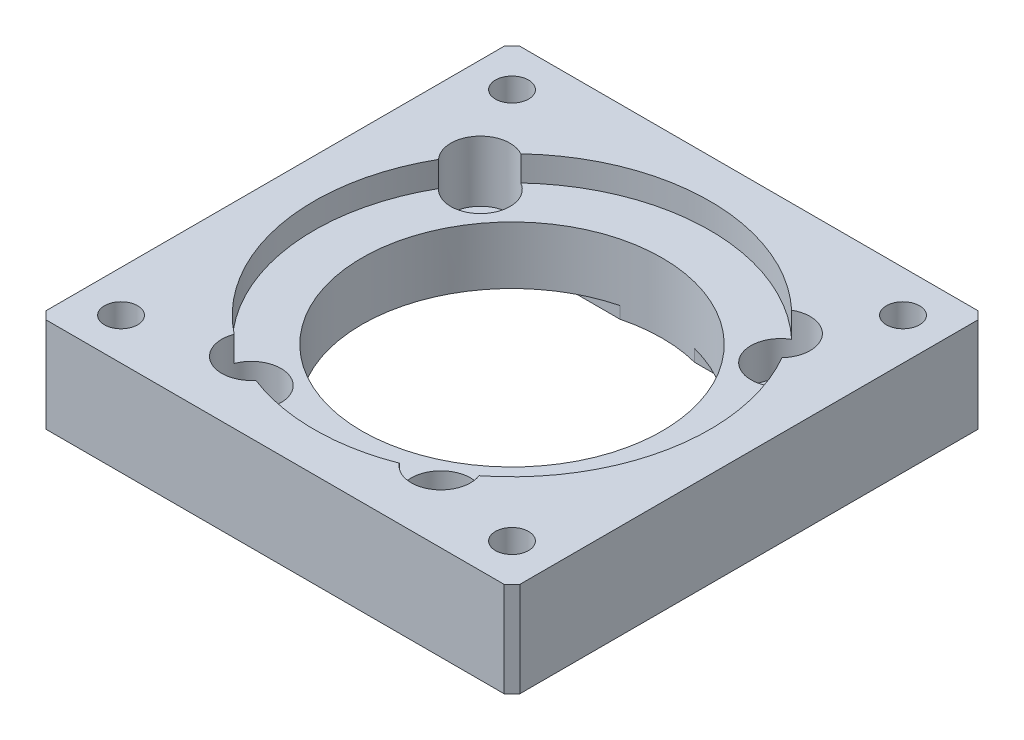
from build123d import *

# Parameters (mm, degrees)
SKETCH_1_W                = 60
SKETCH_1_H                = 60
EXTRUDE_1_DEPTH           = 12
SKETCH_2_R                = 19
CUT_EXTRUDE_1_DEPTH       = 20
CUT_EXTRUDE_2_DEPTH       = 1.5
SKETCH_4_R                = 25.05
CUT_EXTRUDE_3_DEPTH       = 3.2
CHAMFER_1_SIZE            = 1
HOLE_WIZARD_M5_1_D        = 4.2
HOLE_WIZARD_M5_1_DEPTH    = 22.4
HOLE_WIZARD_M5_1_TIP      = 1.2618073
HOLE_WIZARD_1_D           = 4.5
HOLE_WIZARD_1_DEPTH       = 10
HOLE_WIZARD_1_CBORE_D     = 7.5
HOLE_WIZARD_1_CBORE_DEPTH = 7.7
HOLE_WIZARD_1_TIP         = 1.351936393


with BuildPart() as part:
    # Sketch 1 → Extrude 1 (new body)
    with BuildSketch(Plane(origin=(0, 0, 0), x_dir=(1, 0, 0), z_dir=(0, 1, 0))):
        Rectangle(SKETCH_1_W, SKETCH_1_H)
    extrude(amount=EXTRUDE_1_DEPTH)

    # Sketch 2 → Cut-Extrude 1 (cut)
    with BuildSketch(Plane(origin=(0, 12, 0), x_dir=(1, 0, 0), z_dir=(0, 1, 0))):
        with Locations(Location((0, 0, 0), (0, 0, 270))):
            Circle(SKETCH_2_R)
    extrude(amount=-CUT_EXTRUDE_1_DEPTH, mode=Mode.SUBTRACT)

    # Sketch 3 → Cut-Extrude 2 (cut)
    with BuildSketch(Plane.XZ):
        with BuildLine():
            Line((-19, 24), (19, 24))
            ThreePointArc((19, 24), (22.535533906, 22.535533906), (24, 19))
            Line((24, 19), (24, -18.4))
            ThreePointArc((24, -18.4), (20, -22.4), (16, -18.4))
            Line((16, -18.4), (-16, -18.4))
            ThreePointArc((-16, -18.4), (-20, -22.4), (-24, -18.4))
            Line((-24, -18.4), (-24, 19))
            ThreePointArc((-24, 19), (-22.535533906, 22.535533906), (-19, 24))
        make_face()
    extrude(amount=-CUT_EXTRUDE_2_DEPTH, mode=Mode.SUBTRACT)

    # Sketch 4 → Cut-Extrude 3 (cut)
    with BuildSketch(Plane(origin=(0, 12, 0), x_dir=(1, 0, 0), z_dir=(0, 1, 0))):
        with Locations(Location((0, 0, 0), (0, 0, 270))):
            Circle(SKETCH_4_R)
    extrude(amount=-CUT_EXTRUDE_3_DEPTH, mode=Mode.SUBTRACT)

    # Chamfer 1
    chamfer_1_edges = [part.edges().sort_by_distance(p)[0] for p in [
        (30, 6, 30),
        (-30, 6, 30),
        (-30, 6, -30),
        (30, 6, -30),
    ]]
    chamfer(chamfer_1_edges, length=CHAMFER_1_SIZE)

    # Hole Wizard M5 _1
    with Locations(Plane(origin=(0, 12, 0), x_dir=(1, 0, 0), z_dir=(0, 1, 0))):
        with Locations((24.75, 24.75), (-24.75, 24.75), (-24.75, -24.75), (24.75, -24.75)):
            Hole(HOLE_WIZARD_M5_1_D / 2, depth=HOLE_WIZARD_M5_1_DEPTH)
            with Locations((0, 0, -(HOLE_WIZARD_M5_1_DEPTH + HOLE_WIZARD_M5_1_TIP / 2))):  # 118° drill point
                Cone(0, HOLE_WIZARD_M5_1_D / 2, HOLE_WIZARD_M5_1_TIP, mode=Mode.SUBTRACT)

    # Hole Wizard 1
    with Locations(Plane(origin=(0, 12, 0), x_dir=(1, 0, 0), z_dir=(0, 1, 0))):
        with Locations((12, -21), (-12, -21), (-19, 15), (19, 15)):
            CounterBoreHole(HOLE_WIZARD_1_D / 2, HOLE_WIZARD_1_CBORE_D / 2, HOLE_WIZARD_1_CBORE_DEPTH, depth=HOLE_WIZARD_1_DEPTH)
            with Locations((0, 0, -(HOLE_WIZARD_1_DEPTH + HOLE_WIZARD_1_TIP / 2))):  # 118° drill point
                Cone(0, HOLE_WIZARD_1_D / 2, HOLE_WIZARD_1_TIP, mode=Mode.SUBTRACT)


solid = part.part
